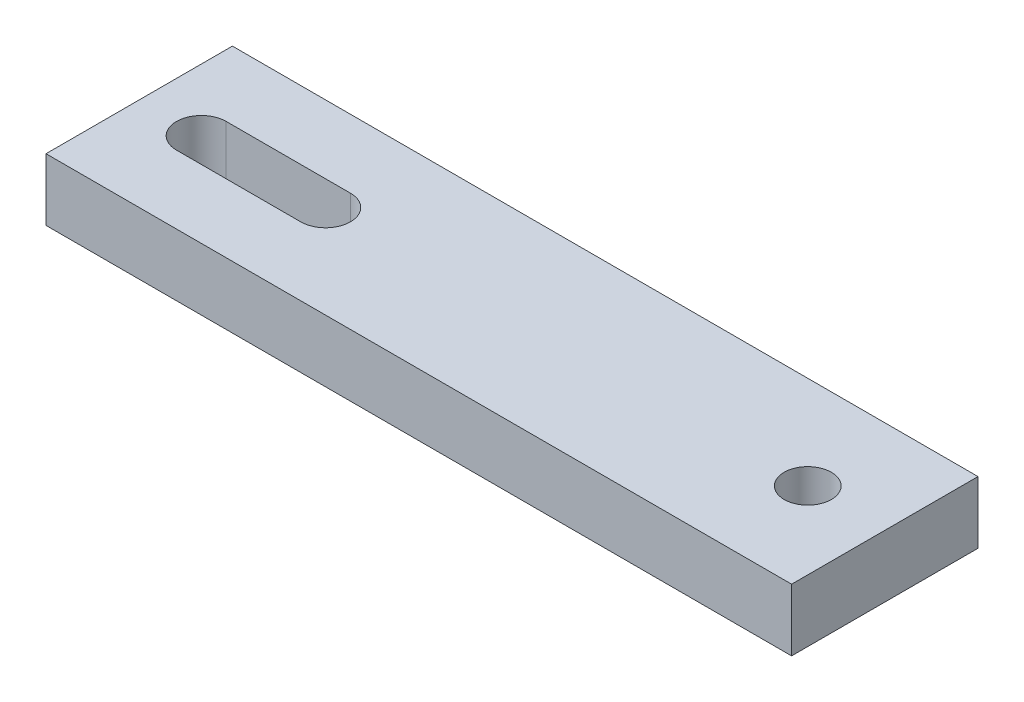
from build123d import *

# Parameters (mm, degrees)
SKETCH1_W              = 76.2
SKETCH1_H              = 19.05
EXTRUDE1_DEPTH         = 6.35
CUT_EXTRUDE1_DEPTH     = 79.801427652
F_10_24_TAPPED_HOLE1_D = 4.826


with BuildPart() as part:
    # Sketch1 → Extrude1 (new body)
    with BuildSketch(Plane(origin=(0, 0, 0), x_dir=(1, 0, 0), z_dir=(0, 1, 0))):
        with Locations((38.1, 9.525)):
            Rectangle(SKETCH1_W, SKETCH1_H)
    extrude(amount=EXTRUDE1_DEPTH)

    # Sketch2 → Cut-Extrude1 (cut, through all)
    with BuildSketch(Plane(origin=(0, 6.35, 0), x_dir=(-1, 0, 0), z_dir=(0, 1, 0))):
        with BuildLine():
            Line((-6.35, -6.985), (-19.05, -6.985))
            ThreePointArc((-19.05, -6.985), (-21.59, -9.525), (-19.05, -12.065))
            Line((-19.05, -12.065), (-6.35, -12.065))
            ThreePointArc((-6.35, -12.065), (-3.81, -9.525), (-6.35, -6.985))
        make_face()
    extrude(amount=-CUT_EXTRUDE1_DEPTH, mode=Mode.SUBTRACT)

    # 10-24 Tapped Hole1 (through all)
    with Locations(Plane(origin=(68.326, 6.35, -9.525), x_dir=(0, 0, 1), z_dir=(0, 1, 0))):
        with Locations((0, 0)):
            Hole(F_10_24_TAPPED_HOLE1_D / 2)


solid = part.part
